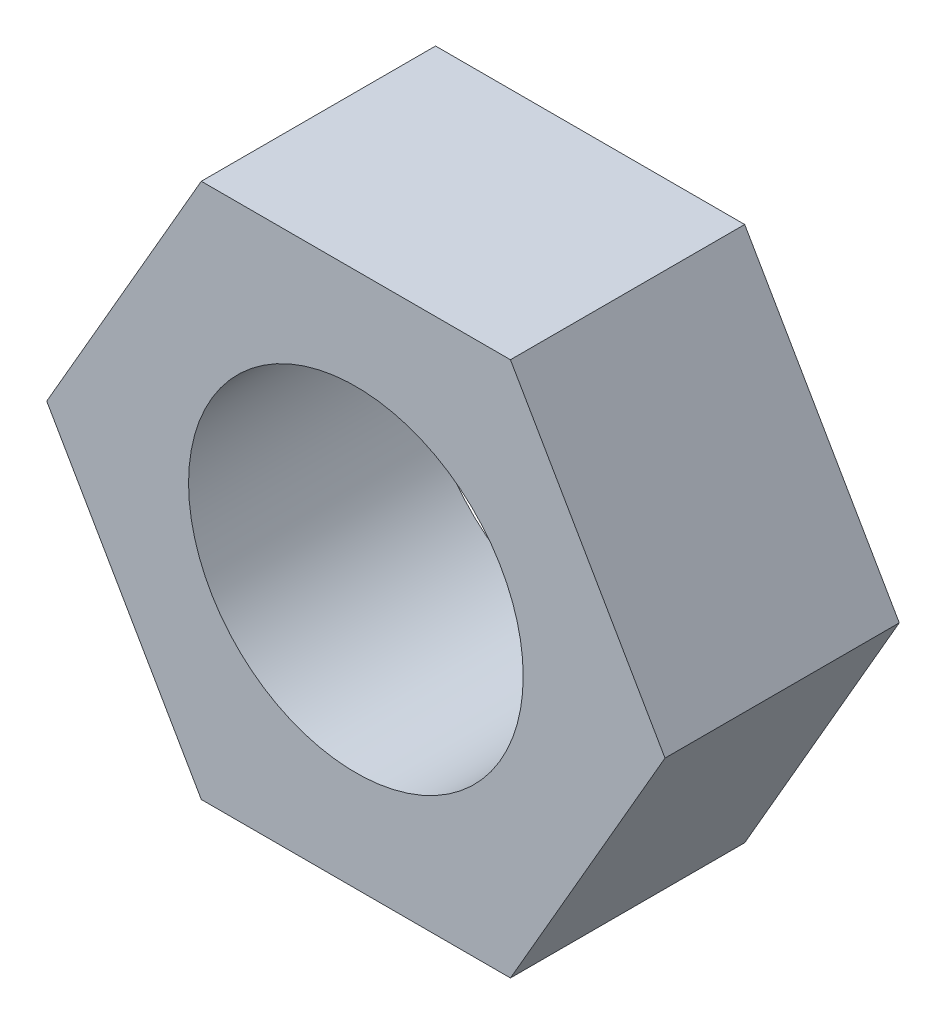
ISO-10303-21;
HEADER;
FILE_DESCRIPTION(('STEP AP214'),'2;1');
FILE_NAME('part.step','',(''),(''),'','','');
FILE_SCHEMA(('AUTOMOTIVE_DESIGN { 1 0 10303 214 1 1 1 1 }'));
ENDSEC;
DATA;
#1=APPLICATION_CONTEXT('core data for automotive mechanical design processes');
#2=APPLICATION_PROTOCOL_DEFINITION('international standard','automotive_design',2000,#1);
#3=PRODUCT_CONTEXT('',#1,'mechanical');
#4=PRODUCT('Part','Part','',(#3));
#5=PRODUCT_RELATED_PRODUCT_CATEGORY('part','',(#4));
#6=PRODUCT_DEFINITION_FORMATION('','',#4);
#7=PRODUCT_DEFINITION_CONTEXT('part definition',#1,'design');
#8=PRODUCT_DEFINITION('design','',#6,#7);
#9=PRODUCT_DEFINITION_SHAPE('','',#8);
#10=(LENGTH_UNIT() NAMED_UNIT(*) SI_UNIT(.MILLI.,.METRE.));
#11=(NAMED_UNIT(*) PLANE_ANGLE_UNIT() SI_UNIT($,.RADIAN.));
#12=(NAMED_UNIT(*) SI_UNIT($,.STERADIAN.) SOLID_ANGLE_UNIT());
#13=UNCERTAINTY_MEASURE_WITH_UNIT(LENGTH_MEASURE(1.E-05),#10,'distance_accuracy_value','');
#14=(GEOMETRIC_REPRESENTATION_CONTEXT(3) GLOBAL_UNCERTAINTY_ASSIGNED_CONTEXT((#13)) GLOBAL_UNIT_ASSIGNED_CONTEXT((#10,
#11,#12)) REPRESENTATION_CONTEXT('',''));
#15=CARTESIAN_POINT('',(0.,0.,0.));
#16=DIRECTION('',(0.,0.,1.));
#17=DIRECTION('',(1.,0.,0.));
#18=AXIS2_PLACEMENT_3D('',#15,#16,#17);
#19=CARTESIAN_POINT('',(0.,0.,3.5));
#20=DIRECTION('',(0.,0.,1.));
#21=DIRECTION('',(1.,0.,0.));
#22=AXIS2_PLACEMENT_3D('',#19,#20,#21);
#23=PLANE('',#22);
#24=DIRECTION('',(0.5,0.866025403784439,0.));
#25=VECTOR('',#24,1.);
#26=CARTESIAN_POINT('',(2.30940107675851,-4.,3.5));
#27=LINE('',#26,#25);
#28=CARTESIAN_POINT('',(2.30940107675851,-4.,3.5));
#29=VERTEX_POINT('',#28);
#30=CARTESIAN_POINT('',(4.61880215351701,0.,3.5));
#31=VERTEX_POINT('',#30);
#32=EDGE_CURVE('E146',#29,#31,#27,.T.);
#33=ORIENTED_EDGE('',*,*,#32,.T.);
#34=DIRECTION('',(-0.5,0.866025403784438,0.));
#35=VECTOR('',#34,1.);
#36=CARTESIAN_POINT('',(4.61880215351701,0.,3.5));
#37=LINE('',#36,#35);
#38=CARTESIAN_POINT('',(2.3094010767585,4.,3.5));
#39=VERTEX_POINT('',#38);
#40=EDGE_CURVE('E94',#31,#39,#37,.T.);
#41=ORIENTED_EDGE('',*,*,#40,.T.);
#42=DIRECTION('',(-1.,0.,0.));
#43=VECTOR('',#42,1.);
#44=CARTESIAN_POINT('',(2.3094010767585,4.,3.5));
#45=LINE('',#44,#43);
#46=CARTESIAN_POINT('',(-2.3094010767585,4.,3.5));
#47=VERTEX_POINT('',#46);
#48=EDGE_CURVE('E107',#39,#47,#45,.T.);
#49=ORIENTED_EDGE('',*,*,#48,.T.);
#50=DIRECTION('',(-0.5,-0.866025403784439,0.));
#51=VECTOR('',#50,1.);
#52=CARTESIAN_POINT('',(-2.3094010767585,4.,3.5));
#53=LINE('',#52,#51);
#54=CARTESIAN_POINT('',(-4.61880215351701,0.,3.5));
#55=VERTEX_POINT('',#54);
#56=EDGE_CURVE('E101',#47,#55,#53,.T.);
#57=ORIENTED_EDGE('',*,*,#56,.T.);
#58=DIRECTION('',(0.5,-0.866025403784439,0.));
#59=VECTOR('',#58,1.);
#60=CARTESIAN_POINT('',(-4.61880215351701,0.,3.5));
#61=LINE('',#60,#59);
#62=CARTESIAN_POINT('',(-2.3094010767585,-4.,3.5));
#63=VERTEX_POINT('',#62);
#64=EDGE_CURVE('E105',#55,#63,#61,.T.);
#65=ORIENTED_EDGE('',*,*,#64,.T.);
#66=DIRECTION('',(1.,0.,0.));
#67=VECTOR('',#66,1.);
#68=CARTESIAN_POINT('',(-2.3094010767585,-4.,3.5));
#69=LINE('',#68,#67);
#70=EDGE_CURVE('E57',#63,#29,#69,.T.);
#71=ORIENTED_EDGE('',*,*,#70,.T.);
#72=EDGE_LOOP('',(#33,#41,#49,#57,#65,#71));
#73=FACE_BOUND('',#72,.T.);
#74=CARTESIAN_POINT('',(0.,0.,3.5));
#75=DIRECTION('',(0.,0.,1.));
#76=DIRECTION('',(1.,0.,0.));
#77=AXIS2_PLACEMENT_3D('',#74,#75,#76);
#78=CIRCLE('',#77,2.5);
#79=CARTESIAN_POINT('',(2.5,0.,3.5));
#80=VERTEX_POINT('',#79);
#81=EDGE_CURVE('E134',#80,#80,#78,.T.);
#82=ORIENTED_EDGE('',*,*,#81,.F.);
#83=EDGE_LOOP('',(#82));
#84=FACE_BOUND('',#83,.T.);
#85=ADVANCED_FACE('F39',(#73,#84),#23,.T.);
#86=CARTESIAN_POINT('',(0.,0.,0.));
#87=DIRECTION('',(0.,0.,1.));
#88=DIRECTION('',(1.,0.,0.));
#89=AXIS2_PLACEMENT_3D('',#86,#87,#88);
#90=PLANE('',#89);
#91=DIRECTION('',(0.5,0.866025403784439,0.));
#92=VECTOR('',#91,1.);
#93=CARTESIAN_POINT('',(2.30940107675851,-4.,0.));
#94=LINE('',#93,#92);
#95=CARTESIAN_POINT('',(2.30940107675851,-4.,0.));
#96=VERTEX_POINT('',#95);
#97=CARTESIAN_POINT('',(4.61880215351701,0.,0.));
#98=VERTEX_POINT('',#97);
#99=EDGE_CURVE('E129',#96,#98,#94,.T.);
#100=ORIENTED_EDGE('',*,*,#99,.F.);
#101=DIRECTION('',(1.,0.,0.));
#102=VECTOR('',#101,1.);
#103=CARTESIAN_POINT('',(-2.3094010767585,-4.,0.));
#104=LINE('',#103,#102);
#105=CARTESIAN_POINT('',(-2.3094010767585,-4.,0.));
#106=VERTEX_POINT('',#105);
#107=EDGE_CURVE('E86',#106,#96,#104,.T.);
#108=ORIENTED_EDGE('',*,*,#107,.F.);
#109=DIRECTION('',(0.5,-0.866025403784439,0.));
#110=VECTOR('',#109,1.);
#111=CARTESIAN_POINT('',(-4.61880215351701,0.,0.));
#112=LINE('',#111,#110);
#113=CARTESIAN_POINT('',(-4.61880215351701,0.,0.));
#114=VERTEX_POINT('',#113);
#115=EDGE_CURVE('E80',#114,#106,#112,.T.);
#116=ORIENTED_EDGE('',*,*,#115,.F.);
#117=DIRECTION('',(-0.5,-0.866025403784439,0.));
#118=VECTOR('',#117,1.);
#119=CARTESIAN_POINT('',(-2.3094010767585,4.,0.));
#120=LINE('',#119,#118);
#121=CARTESIAN_POINT('',(-2.3094010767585,4.,0.));
#122=VERTEX_POINT('',#121);
#123=EDGE_CURVE('E116',#122,#114,#120,.T.);
#124=ORIENTED_EDGE('',*,*,#123,.F.);
#125=DIRECTION('',(-1.,0.,0.));
#126=VECTOR('',#125,1.);
#127=CARTESIAN_POINT('',(2.3094010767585,4.,0.));
#128=LINE('',#127,#126);
#129=CARTESIAN_POINT('',(2.3094010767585,4.,0.));
#130=VERTEX_POINT('',#129);
#131=EDGE_CURVE('E137',#130,#122,#128,.T.);
#132=ORIENTED_EDGE('',*,*,#131,.F.);
#133=DIRECTION('',(-0.5,0.866025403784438,0.));
#134=VECTOR('',#133,1.);
#135=CARTESIAN_POINT('',(4.61880215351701,0.,0.));
#136=LINE('',#135,#134);
#137=EDGE_CURVE('E133',#98,#130,#136,.T.);
#138=ORIENTED_EDGE('',*,*,#137,.F.);
#139=EDGE_LOOP('',(#100,#108,#116,#124,#132,#138));
#140=FACE_BOUND('',#139,.T.);
#141=CARTESIAN_POINT('',(0.,0.,0.));
#142=DIRECTION('',(0.,0.,1.));
#143=DIRECTION('',(1.,0.,0.));
#144=AXIS2_PLACEMENT_3D('',#141,#142,#143);
#145=CIRCLE('',#144,2.5);
#146=CARTESIAN_POINT('',(2.5,0.,0.));
#147=VERTEX_POINT('',#146);
#148=EDGE_CURVE('E243',#147,#147,#145,.T.);
#149=ORIENTED_EDGE('',*,*,#148,.T.);
#150=EDGE_LOOP('',(#149));
#151=FACE_BOUND('',#150,.T.);
#152=ADVANCED_FACE('F159',(#140,#151),#90,.F.);
#153=CARTESIAN_POINT('',(2.30940107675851,-4.,3.5));
#154=DIRECTION('',(-0.866025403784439,0.5,0.));
#155=DIRECTION('',(-0.5,-0.866025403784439,0.));
#156=AXIS2_PLACEMENT_3D('',#153,#154,#155);
#157=PLANE('',#156);
#158=ORIENTED_EDGE('',*,*,#99,.T.);
#159=DIRECTION('',(0.,0.,-1.));
#160=VECTOR('',#159,1.);
#161=CARTESIAN_POINT('',(4.61880215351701,0.,3.5));
#162=LINE('',#161,#160);
#163=EDGE_CURVE('E11',#31,#98,#162,.T.);
#164=ORIENTED_EDGE('',*,*,#163,.F.);
#165=ORIENTED_EDGE('',*,*,#32,.F.);
#166=DIRECTION('',(0.,0.,-1.));
#167=VECTOR('',#166,1.);
#168=CARTESIAN_POINT('',(2.30940107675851,-4.,3.5));
#169=LINE('',#168,#167);
#170=EDGE_CURVE('E125',#29,#96,#169,.T.);
#171=ORIENTED_EDGE('',*,*,#170,.T.);
#172=EDGE_LOOP('',(#158,#164,#165,#171));
#173=FACE_BOUND('',#172,.T.);
#174=ADVANCED_FACE('F41',(#173),#157,.F.);
#175=CARTESIAN_POINT('',(4.61880215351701,0.,3.5));
#176=DIRECTION('',(-0.866025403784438,-0.5,0.));
#177=DIRECTION('',(0.5,-0.866025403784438,0.));
#178=AXIS2_PLACEMENT_3D('',#175,#176,#177);
#179=PLANE('',#178);
#180=ORIENTED_EDGE('',*,*,#137,.T.);
#181=DIRECTION('',(0.,0.,-1.));
#182=VECTOR('',#181,1.);
#183=CARTESIAN_POINT('',(2.3094010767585,4.,3.5));
#184=LINE('',#183,#182);
#185=EDGE_CURVE('E49',#39,#130,#184,.T.);
#186=ORIENTED_EDGE('',*,*,#185,.F.);
#187=ORIENTED_EDGE('',*,*,#40,.F.);
#188=ORIENTED_EDGE('',*,*,#163,.T.);
#189=EDGE_LOOP('',(#180,#186,#187,#188));
#190=FACE_BOUND('',#189,.T.);
#191=ADVANCED_FACE('F184',(#190),#179,.F.);
#192=CARTESIAN_POINT('',(2.3094010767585,4.,3.5));
#193=DIRECTION('',(0.,-1.,0.));
#194=DIRECTION('',(1.,0.,0.));
#195=AXIS2_PLACEMENT_3D('',#192,#193,#194);
#196=PLANE('',#195);
#197=ORIENTED_EDGE('',*,*,#131,.T.);
#198=DIRECTION('',(0.,0.,-1.));
#199=VECTOR('',#198,1.);
#200=CARTESIAN_POINT('',(-2.3094010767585,4.,3.5));
#201=LINE('',#200,#199);
#202=EDGE_CURVE('E118',#47,#122,#201,.T.);
#203=ORIENTED_EDGE('',*,*,#202,.F.);
#204=ORIENTED_EDGE('',*,*,#48,.F.);
#205=ORIENTED_EDGE('',*,*,#185,.T.);
#206=EDGE_LOOP('',(#197,#203,#204,#205));
#207=FACE_BOUND('',#206,.T.);
#208=ADVANCED_FACE('F156',(#207),#196,.F.);
#209=CARTESIAN_POINT('',(-2.3094010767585,4.,3.5));
#210=DIRECTION('',(0.866025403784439,-0.5,0.));
#211=DIRECTION('',(0.5,0.866025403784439,0.));
#212=AXIS2_PLACEMENT_3D('',#209,#210,#211);
#213=PLANE('',#212);
#214=ORIENTED_EDGE('',*,*,#123,.T.);
#215=DIRECTION('',(0.,0.,-1.));
#216=VECTOR('',#215,1.);
#217=CARTESIAN_POINT('',(-4.61880215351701,0.,3.5));
#218=LINE('',#217,#216);
#219=EDGE_CURVE('E113',#55,#114,#218,.T.);
#220=ORIENTED_EDGE('',*,*,#219,.F.);
#221=ORIENTED_EDGE('',*,*,#56,.F.);
#222=ORIENTED_EDGE('',*,*,#202,.T.);
#223=EDGE_LOOP('',(#214,#220,#221,#222));
#224=FACE_BOUND('',#223,.T.);
#225=ADVANCED_FACE('F114',(#224),#213,.F.);
#226=CARTESIAN_POINT('',(-4.61880215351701,0.,3.5));
#227=DIRECTION('',(0.866025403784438,0.5,0.));
#228=DIRECTION('',(-0.5,0.866025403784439,0.));
#229=AXIS2_PLACEMENT_3D('',#226,#227,#228);
#230=PLANE('',#229);
#231=ORIENTED_EDGE('',*,*,#115,.T.);
#232=DIRECTION('',(0.,0.,-1.));
#233=VECTOR('',#232,1.);
#234=CARTESIAN_POINT('',(-2.3094010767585,-4.,3.5));
#235=LINE('',#234,#233);
#236=EDGE_CURVE('E119',#63,#106,#235,.T.);
#237=ORIENTED_EDGE('',*,*,#236,.F.);
#238=ORIENTED_EDGE('',*,*,#64,.F.);
#239=ORIENTED_EDGE('',*,*,#219,.T.);
#240=EDGE_LOOP('',(#231,#237,#238,#239));
#241=FACE_BOUND('',#240,.T.);
#242=ADVANCED_FACE('F121',(#241),#230,.F.);
#243=CARTESIAN_POINT('',(-2.3094010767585,-4.,3.5));
#244=DIRECTION('',(0.,1.,0.));
#245=DIRECTION('',(0.,0.,1.));
#246=AXIS2_PLACEMENT_3D('',#243,#244,#245);
#247=PLANE('',#246);
#248=ORIENTED_EDGE('',*,*,#107,.T.);
#249=ORIENTED_EDGE('',*,*,#170,.F.);
#250=ORIENTED_EDGE('',*,*,#70,.F.);
#251=ORIENTED_EDGE('',*,*,#236,.T.);
#252=EDGE_LOOP('',(#248,#249,#250,#251));
#253=FACE_BOUND('',#252,.T.);
#254=ADVANCED_FACE('F164',(#253),#247,.F.);
#255=CARTESIAN_POINT('',(0.,0.,3.5));
#256=DIRECTION('',(0.,0.,-1.));
#257=DIRECTION('',(-1.,0.,0.));
#258=AXIS2_PLACEMENT_3D('',#255,#256,#257);
#259=CYLINDRICAL_SURFACE('',#258,2.5);
#260=ORIENTED_EDGE('',*,*,#81,.T.);
#261=EDGE_LOOP('',(#260));
#262=FACE_BOUND('',#261,.T.);
#263=ORIENTED_EDGE('',*,*,#148,.F.);
#264=EDGE_LOOP('',(#263));
#265=FACE_BOUND('',#264,.T.);
#266=ADVANCED_FACE('F166',(#262,#265),#259,.F.);
#267=CLOSED_SHELL('',(#85,#152,#174,#191,#208,#225,#242,#254,#266));
#268=MANIFOLD_SOLID_BREP('B2',#267);
#269=ADVANCED_BREP_SHAPE_REPRESENTATION('',(#18,#268),#14);
#270=SHAPE_DEFINITION_REPRESENTATION(#9,#269);
ENDSEC;
END-ISO-10303-21;
